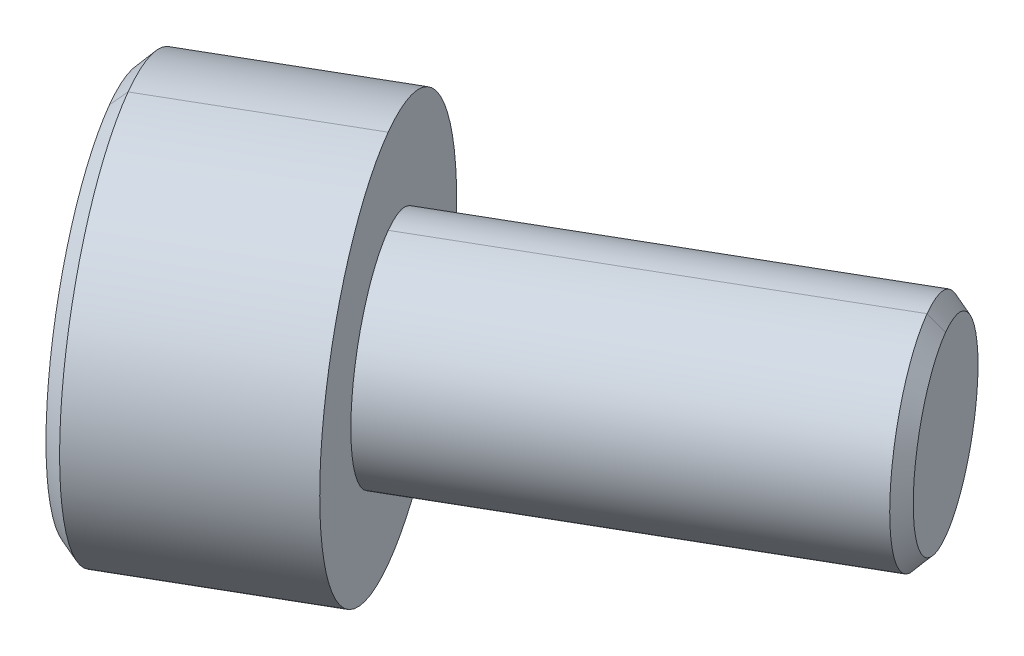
ISO-10303-21;
HEADER;
FILE_DESCRIPTION(('STEP AP214'),'2;1');
FILE_NAME('part.step','',(''),(''),'','','');
FILE_SCHEMA(('AUTOMOTIVE_DESIGN { 1 0 10303 214 1 1 1 1 }'));
ENDSEC;
DATA;
#1=APPLICATION_CONTEXT('core data for automotive mechanical design processes');
#2=APPLICATION_PROTOCOL_DEFINITION('international standard','automotive_design',2000,#1);
#3=PRODUCT_CONTEXT('',#1,'mechanical');
#4=PRODUCT('Part','Part','',(#3));
#5=PRODUCT_RELATED_PRODUCT_CATEGORY('part','',(#4));
#6=PRODUCT_DEFINITION_FORMATION('','',#4);
#7=PRODUCT_DEFINITION_CONTEXT('part definition',#1,'design');
#8=PRODUCT_DEFINITION('design','',#6,#7);
#9=PRODUCT_DEFINITION_SHAPE('','',#8);
#10=(LENGTH_UNIT() NAMED_UNIT(*) SI_UNIT(.MILLI.,.METRE.));
#11=(NAMED_UNIT(*) PLANE_ANGLE_UNIT() SI_UNIT($,.RADIAN.));
#12=(NAMED_UNIT(*) SI_UNIT($,.STERADIAN.) SOLID_ANGLE_UNIT());
#13=UNCERTAINTY_MEASURE_WITH_UNIT(LENGTH_MEASURE(1.E-05),#10,'distance_accuracy_value','');
#14=(GEOMETRIC_REPRESENTATION_CONTEXT(3) GLOBAL_UNCERTAINTY_ASSIGNED_CONTEXT((#13)) GLOBAL_UNIT_ASSIGNED_CONTEXT((#10,
#11,#12)) REPRESENTATION_CONTEXT('',''));
#15=CARTESIAN_POINT('',(0.,0.,0.));
#16=DIRECTION('',(0.,0.,1.));
#17=DIRECTION('',(1.,0.,0.));
#18=AXIS2_PLACEMENT_3D('',#15,#16,#17);
#19=CARTESIAN_POINT('',(-45.29312861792,9.,26.15));
#20=DIRECTION('',(-0.866025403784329,0.,0.50000000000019));
#21=DIRECTION('',(0.,1.,0.));
#22=AXIS2_PLACEMENT_3D('',#19,#20,#21);
#23=PLANE('',#22);
#24=DIRECTION('',(0.250000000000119,0.866025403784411,0.433012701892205));
#25=VECTOR('',#24,1.);
#26=CARTESIAN_POINT('',(-45.65397253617,10.25,25.525));
#27=LINE('',#26,#25);
#28=CARTESIAN_POINT('',(-46.01481645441,9.,24.9));
#29=VERTEX_POINT('',#28);
#30=CARTESIAN_POINT('',(-45.65397253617,10.25,25.525));
#31=VERTEX_POINT('',#30);
#32=EDGE_CURVE('E227',#29,#31,#27,.T.);
#33=ORIENTED_EDGE('',*,*,#32,.F.);
#34=DIRECTION('',(-0.250000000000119,0.866025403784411,-0.433012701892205));
#35=VECTOR('',#34,1.);
#36=CARTESIAN_POINT('',(-46.01481645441,9.,24.9));
#37=LINE('',#36,#35);
#38=CARTESIAN_POINT('',(-45.65397253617,7.75,25.525));
#39=VERTEX_POINT('',#38);
#40=EDGE_CURVE('E10',#39,#29,#37,.T.);
#41=ORIENTED_EDGE('',*,*,#40,.F.);
#42=DIRECTION('',(-0.50000000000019,0.,-0.866025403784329));
#43=VECTOR('',#42,1.);
#44=CARTESIAN_POINT('',(-45.65397253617,7.75,25.525));
#45=LINE('',#44,#43);
#46=CARTESIAN_POINT('',(-44.93228469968,7.75,26.775));
#47=VERTEX_POINT('',#46);
#48=EDGE_CURVE('E46',#47,#39,#45,.T.);
#49=ORIENTED_EDGE('',*,*,#48,.F.);
#50=DIRECTION('',(-0.250000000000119,-0.866025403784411,-0.433012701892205));
#51=VECTOR('',#50,1.);
#52=CARTESIAN_POINT('',(-44.93228469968,7.75,26.775));
#53=LINE('',#52,#51);
#54=CARTESIAN_POINT('',(-44.57144078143,9.,27.4));
#55=VERTEX_POINT('',#54);
#56=EDGE_CURVE('E189',#55,#47,#53,.T.);
#57=ORIENTED_EDGE('',*,*,#56,.F.);
#58=DIRECTION('',(0.250000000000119,-0.866025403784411,0.433012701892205));
#59=VECTOR('',#58,1.);
#60=CARTESIAN_POINT('',(-44.57144078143,9.,27.4));
#61=LINE('',#60,#59);
#62=CARTESIAN_POINT('',(-44.93228469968,10.25,26.775));
#63=VERTEX_POINT('',#62);
#64=EDGE_CURVE('E214',#63,#55,#61,.T.);
#65=ORIENTED_EDGE('',*,*,#64,.F.);
#66=DIRECTION('',(0.50000000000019,0.,0.866025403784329));
#67=VECTOR('',#66,1.);
#68=CARTESIAN_POINT('',(-44.93228469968,10.25,26.775));
#69=LINE('',#68,#67);
#70=EDGE_CURVE('E226',#31,#63,#69,.T.);
#71=ORIENTED_EDGE('',*,*,#70,.F.);
#72=EDGE_LOOP('',(#33,#41,#49,#57,#65,#71));
#73=FACE_BOUND('',#72,.T.);
#74=ADVANCED_FACE('F16',(#73),#23,.T.);
#75=CARTESIAN_POINT('',(-46.01481645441,9.,24.9));
#76=DIRECTION('',(0.433012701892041,0.500000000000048,0.750000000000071));
#77=DIRECTION('',(0.755928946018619,-0.654653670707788,0.));
#78=AXIS2_PLACEMENT_3D('',#75,#76,#77);
#79=PLANE('',#78);
#80=DIRECTION('',(-0.250000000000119,0.866025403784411,-0.433012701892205));
#81=VECTOR('',#80,1.);
#82=CARTESIAN_POINT('',(-47.31385456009,9.,25.65));
#83=LINE('',#82,#81);
#84=CARTESIAN_POINT('',(-46.95301064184,7.75,26.275));
#85=VERTEX_POINT('',#84);
#86=CARTESIAN_POINT('',(-47.31385456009,9.,25.65));
#87=VERTEX_POINT('',#86);
#88=EDGE_CURVE('E202',#85,#87,#83,.T.);
#89=ORIENTED_EDGE('',*,*,#88,.F.);
#90=DIRECTION('',(-0.866025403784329,0.,0.50000000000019));
#91=VECTOR('',#90,1.);
#92=CARTESIAN_POINT('',(-45.65397253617,7.75,25.525));
#93=LINE('',#92,#91);
#94=EDGE_CURVE('E26',#39,#85,#93,.T.);
#95=ORIENTED_EDGE('',*,*,#94,.F.);
#96=ORIENTED_EDGE('',*,*,#40,.T.);
#97=DIRECTION('',(-0.866025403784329,0.,0.50000000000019));
#98=VECTOR('',#97,1.);
#99=CARTESIAN_POINT('',(-46.01481645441,9.,24.9));
#100=LINE('',#99,#98);
#101=EDGE_CURVE('E231',#29,#87,#100,.T.);
#102=ORIENTED_EDGE('',*,*,#101,.T.);
#103=EDGE_LOOP('',(#89,#95,#96,#102));
#104=FACE_BOUND('',#103,.T.);
#105=ADVANCED_FACE('F326',(#104),#79,.T.);
#106=CARTESIAN_POINT('',(-45.65397253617,7.75,25.525));
#107=DIRECTION('',(0.,1.,0.));
#108=DIRECTION('',(0.,0.,-1.));
#109=AXIS2_PLACEMENT_3D('',#106,#107,#108);
#110=PLANE('',#109);
#111=DIRECTION('',(-0.50000000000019,0.,-0.866025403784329));
#112=VECTOR('',#111,1.);
#113=CARTESIAN_POINT('',(-46.95301064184,7.75,26.275));
#114=LINE('',#113,#112);
#115=CARTESIAN_POINT('',(-46.23132280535,7.75,27.525));
#116=VERTEX_POINT('',#115);
#117=EDGE_CURVE('E160',#116,#85,#114,.T.);
#118=ORIENTED_EDGE('',*,*,#117,.F.);
#119=DIRECTION('',(-0.866025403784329,0.,0.50000000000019));
#120=VECTOR('',#119,1.);
#121=CARTESIAN_POINT('',(-44.93228469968,7.75,26.775));
#122=LINE('',#121,#120);
#123=EDGE_CURVE('E192',#47,#116,#122,.T.);
#124=ORIENTED_EDGE('',*,*,#123,.F.);
#125=ORIENTED_EDGE('',*,*,#48,.T.);
#126=ORIENTED_EDGE('',*,*,#94,.T.);
#127=EDGE_LOOP('',(#118,#124,#125,#126));
#128=FACE_BOUND('',#127,.T.);
#129=ADVANCED_FACE('F331',(#128),#110,.T.);
#130=CARTESIAN_POINT('',(-44.93228469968,7.75,26.775));
#131=DIRECTION('',(-0.433012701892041,0.500000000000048,-0.750000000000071));
#132=DIRECTION('',(-0.866025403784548,0.,0.49999999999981));
#133=AXIS2_PLACEMENT_3D('',#130,#131,#132);
#134=PLANE('',#133);
#135=DIRECTION('',(-0.250000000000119,-0.866025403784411,-0.433012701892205));
#136=VECTOR('',#135,1.);
#137=CARTESIAN_POINT('',(-46.23132280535,7.75,27.525));
#138=LINE('',#137,#136);
#139=CARTESIAN_POINT('',(-45.87047888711,9.,28.15));
#140=VERTEX_POINT('',#139);
#141=EDGE_CURVE('E203',#140,#116,#138,.T.);
#142=ORIENTED_EDGE('',*,*,#141,.F.);
#143=DIRECTION('',(-0.866025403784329,0.,0.50000000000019));
#144=VECTOR('',#143,1.);
#145=CARTESIAN_POINT('',(-44.57144078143,9.,27.4));
#146=LINE('',#145,#144);
#147=EDGE_CURVE('E193',#55,#140,#146,.T.);
#148=ORIENTED_EDGE('',*,*,#147,.F.);
#149=ORIENTED_EDGE('',*,*,#56,.T.);
#150=ORIENTED_EDGE('',*,*,#123,.T.);
#151=EDGE_LOOP('',(#142,#148,#149,#150));
#152=FACE_BOUND('',#151,.T.);
#153=ADVANCED_FACE('F341',(#152),#134,.T.);
#154=CARTESIAN_POINT('',(-44.57144078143,9.,27.4));
#155=DIRECTION('',(-0.433012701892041,-0.500000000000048,-0.750000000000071));
#156=DIRECTION('',(0.,-0.832050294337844,0.554700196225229));
#157=AXIS2_PLACEMENT_3D('',#154,#155,#156);
#158=PLANE('',#157);
#159=DIRECTION('',(0.250000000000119,-0.866025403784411,0.433012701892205));
#160=VECTOR('',#159,1.);
#161=CARTESIAN_POINT('',(-45.87047888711,9.,28.15));
#162=LINE('',#161,#160);
#163=CARTESIAN_POINT('',(-46.23132280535,10.25,27.525));
#164=VERTEX_POINT('',#163);
#165=EDGE_CURVE('E207',#164,#140,#162,.T.);
#166=ORIENTED_EDGE('',*,*,#165,.F.);
#167=DIRECTION('',(-0.866025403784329,0.,0.50000000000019));
#168=VECTOR('',#167,1.);
#169=CARTESIAN_POINT('',(-44.93228469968,10.25,26.775));
#170=LINE('',#169,#168);
#171=EDGE_CURVE('E245',#63,#164,#170,.T.);
#172=ORIENTED_EDGE('',*,*,#171,.F.);
#173=ORIENTED_EDGE('',*,*,#64,.T.);
#174=ORIENTED_EDGE('',*,*,#147,.T.);
#175=EDGE_LOOP('',(#166,#172,#173,#174));
#176=FACE_BOUND('',#175,.T.);
#177=ADVANCED_FACE('F343',(#176),#158,.T.);
#178=CARTESIAN_POINT('',(-44.93228469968,10.25,26.775));
#179=DIRECTION('',(0.,-1.,0.));
#180=DIRECTION('',(0.,0.,-1.));
#181=AXIS2_PLACEMENT_3D('',#178,#179,#180);
#182=PLANE('',#181);
#183=DIRECTION('',(0.50000000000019,0.,0.866025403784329));
#184=VECTOR('',#183,1.);
#185=CARTESIAN_POINT('',(-46.23132280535,10.25,27.525));
#186=LINE('',#185,#184);
#187=CARTESIAN_POINT('',(-46.95301064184,10.25,26.275));
#188=VERTEX_POINT('',#187);
#189=EDGE_CURVE('E201',#188,#164,#186,.T.);
#190=ORIENTED_EDGE('',*,*,#189,.F.);
#191=DIRECTION('',(-0.866025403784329,0.,0.50000000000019));
#192=VECTOR('',#191,1.);
#193=CARTESIAN_POINT('',(-45.65397253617,10.25,25.525));
#194=LINE('',#193,#192);
#195=EDGE_CURVE('E223',#31,#188,#194,.T.);
#196=ORIENTED_EDGE('',*,*,#195,.F.);
#197=ORIENTED_EDGE('',*,*,#70,.T.);
#198=ORIENTED_EDGE('',*,*,#171,.T.);
#199=EDGE_LOOP('',(#190,#196,#197,#198));
#200=FACE_BOUND('',#199,.T.);
#201=ADVANCED_FACE('F356',(#200),#182,.T.);
#202=CARTESIAN_POINT('',(-45.65397253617,10.25,25.525));
#203=DIRECTION('',(0.433012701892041,-0.500000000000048,0.750000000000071));
#204=DIRECTION('',(-0.755928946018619,-0.654653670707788,0.));
#205=AXIS2_PLACEMENT_3D('',#202,#203,#204);
#206=PLANE('',#205);
#207=DIRECTION('',(0.250000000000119,0.866025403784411,0.433012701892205));
#208=VECTOR('',#207,1.);
#209=CARTESIAN_POINT('',(-46.95301064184,10.25,26.275));
#210=LINE('',#209,#208);
#211=EDGE_CURVE('E197',#87,#188,#210,.T.);
#212=ORIENTED_EDGE('',*,*,#211,.F.);
#213=ORIENTED_EDGE('',*,*,#101,.F.);
#214=ORIENTED_EDGE('',*,*,#32,.T.);
#215=ORIENTED_EDGE('',*,*,#195,.T.);
#216=EDGE_LOOP('',(#212,#213,#214,#215));
#217=FACE_BOUND('',#216,.T.);
#218=ADVANCED_FACE('F340',(#217),#206,.T.);
#219=CARTESIAN_POINT('',(-39.44793808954,9.,21.27416697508));
#220=DIRECTION('',(0.866025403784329,0.,-0.50000000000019));
#221=DIRECTION('',(0.,-1.,0.));
#222=AXIS2_PLACEMENT_3D('',#219,#220,#221);
#223=PLANE('',#222);
#224=CARTESIAN_POINT('',(-38.79793808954,9.,22.4));
#225=DIRECTION('',(-0.866025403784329,0.,0.50000000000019));
#226=DIRECTION('',(0.,1.,0.));
#227=AXIS2_PLACEMENT_3D('',#224,#225,#226);
#228=CIRCLE('',#227,1.3);
#229=CARTESIAN_POINT('',(-38.79793808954,10.3,22.4));
#230=VERTEX_POINT('',#229);
#231=CARTESIAN_POINT('',(-38.79793808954,7.7,22.4));
#232=VERTEX_POINT('',#231);
#233=EDGE_CURVE('E277',#230,#232,#228,.T.);
#234=ORIENTED_EDGE('',*,*,#233,.F.);
#235=CARTESIAN_POINT('',(-38.79793808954,9.,22.4));
#236=DIRECTION('',(-0.866025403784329,0.,0.50000000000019));
#237=DIRECTION('',(0.,1.,0.));
#238=AXIS2_PLACEMENT_3D('',#235,#236,#237);
#239=CIRCLE('',#238,1.3);
#240=EDGE_CURVE('E59',#232,#230,#239,.T.);
#241=ORIENTED_EDGE('',*,*,#240,.F.);
#242=EDGE_LOOP('',(#234,#241));
#243=FACE_BOUND('',#242,.T.);
#244=ADVANCED_FACE('F337',(#243),#223,.T.);
#245=CARTESIAN_POINT('',(-38.9711431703,9.,22.5));
#246=DIRECTION('',(-0.866025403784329,0.,0.50000000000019));
#247=DIRECTION('',(0.,1.,0.));
#248=AXIS2_PLACEMENT_3D('',#245,#246,#247);
#249=CONICAL_SURFACE('',#248,1.5,0.785398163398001);
#250=DIRECTION('',(-0.612372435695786,-0.707106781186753,0.353553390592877));
#251=VECTOR('',#250,1.);
#252=CARTESIAN_POINT('',(-38.9711431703,7.5,22.5));
#253=LINE('',#252,#251);
#254=CARTESIAN_POINT('',(-38.9711431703,7.5,22.5));
#255=VERTEX_POINT('',#254);
#256=EDGE_CURVE('E240',#232,#255,#253,.T.);
#257=ORIENTED_EDGE('',*,*,#256,.F.);
#258=ORIENTED_EDGE('',*,*,#240,.T.);
#259=DIRECTION('',(-0.612372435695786,0.707106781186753,0.353553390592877));
#260=VECTOR('',#259,1.);
#261=CARTESIAN_POINT('',(-38.9711431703,10.5,22.5));
#262=LINE('',#261,#260);
#263=CARTESIAN_POINT('',(-38.9711431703,10.5,22.5));
#264=VERTEX_POINT('',#263);
#265=EDGE_CURVE('E239',#230,#264,#262,.T.);
#266=ORIENTED_EDGE('',*,*,#265,.T.);
#267=CARTESIAN_POINT('',(-38.9711431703,9.,22.5));
#268=DIRECTION('',(-0.866025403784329,0.,0.50000000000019));
#269=DIRECTION('',(0.,1.,0.));
#270=AXIS2_PLACEMENT_3D('',#267,#268,#269);
#271=CIRCLE('',#270,1.5);
#272=EDGE_CURVE('E264',#255,#264,#271,.T.);
#273=ORIENTED_EDGE('',*,*,#272,.F.);
#274=EDGE_LOOP('',(#257,#258,#266,#273));
#275=FACE_BOUND('',#274,.T.);
#276=ADVANCED_FACE('F18',(#275),#249,.T.);
#277=CARTESIAN_POINT('',(-477.0067924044,9.,275.4));
#278=DIRECTION('',(-0.866025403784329,0.,0.50000000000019));
#279=DIRECTION('',(0.,1.,0.));
#280=AXIS2_PLACEMENT_3D('',#277,#278,#279);
#281=CYLINDRICAL_SURFACE('',#280,1.5);
#282=DIRECTION('',(-0.866025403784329,0.,0.50000000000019));
#283=VECTOR('',#282,1.);
#284=CARTESIAN_POINT('',(-477.0067924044,7.5,275.4));
#285=LINE('',#284,#283);
#286=CARTESIAN_POINT('',(-43.99409051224,7.5,25.4));
#287=VERTEX_POINT('',#286);
#288=EDGE_CURVE('E222',#255,#287,#285,.T.);
#289=ORIENTED_EDGE('',*,*,#288,.F.);
#290=ORIENTED_EDGE('',*,*,#272,.T.);
#291=DIRECTION('',(-0.866025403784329,0.,0.50000000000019));
#292=VECTOR('',#291,1.);
#293=CARTESIAN_POINT('',(-477.0067924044,10.5,275.4));
#294=LINE('',#293,#292);
#295=CARTESIAN_POINT('',(-43.99409051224,10.5,25.4));
#296=VERTEX_POINT('',#295);
#297=EDGE_CURVE('E184',#264,#296,#294,.T.);
#298=ORIENTED_EDGE('',*,*,#297,.T.);
#299=CARTESIAN_POINT('',(-43.99409051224,9.,25.4));
#300=DIRECTION('',(-0.866025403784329,0.,0.50000000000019));
#301=DIRECTION('',(0.,1.,0.));
#302=AXIS2_PLACEMENT_3D('',#299,#300,#301);
#303=CIRCLE('',#302,1.5);
#304=EDGE_CURVE('E234',#287,#296,#303,.T.);
#305=ORIENTED_EDGE('',*,*,#304,.F.);
#306=EDGE_LOOP('',(#289,#290,#298,#305));
#307=FACE_BOUND('',#306,.T.);
#308=ADVANCED_FACE('F289',(#307),#281,.T.);
#309=CARTESIAN_POINT('',(-45.36909051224,9.,23.018430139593));
#310=DIRECTION('',(0.866025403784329,0.,-0.50000000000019));
#311=DIRECTION('',(0.,-1.,0.));
#312=AXIS2_PLACEMENT_3D('',#309,#310,#311);
#313=PLANE('',#312);
#314=CARTESIAN_POINT('',(-43.99409051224,9.,25.4));
#315=DIRECTION('',(-0.866025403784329,0.,0.50000000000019));
#316=DIRECTION('',(0.,1.,0.));
#317=AXIS2_PLACEMENT_3D('',#314,#315,#316);
#318=CIRCLE('',#317,2.75);
#319=CARTESIAN_POINT('',(-43.99409051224,11.75,25.4));
#320=VERTEX_POINT('',#319);
#321=CARTESIAN_POINT('',(-43.99409051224,6.25,25.4));
#322=VERTEX_POINT('',#321);
#323=EDGE_CURVE('E177',#320,#322,#318,.T.);
#324=ORIENTED_EDGE('',*,*,#323,.F.);
#325=CARTESIAN_POINT('',(-43.99409051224,9.,25.4));
#326=DIRECTION('',(-0.866025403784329,0.,0.50000000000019));
#327=DIRECTION('',(0.,1.,0.));
#328=AXIS2_PLACEMENT_3D('',#325,#326,#327);
#329=CIRCLE('',#328,2.75);
#330=EDGE_CURVE('E139',#322,#320,#329,.T.);
#331=ORIENTED_EDGE('',*,*,#330,.F.);
#332=EDGE_LOOP('',(#324,#331));
#333=FACE_BOUND('',#332,.T.);
#334=CARTESIAN_POINT('',(-43.99409051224,9.,25.4));
#335=DIRECTION('',(-0.866025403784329,0.,0.50000000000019));
#336=DIRECTION('',(0.,1.,0.));
#337=AXIS2_PLACEMENT_3D('',#334,#335,#336);
#338=CIRCLE('',#337,1.5);
#339=EDGE_CURVE('E218',#296,#287,#338,.T.);
#340=ORIENTED_EDGE('',*,*,#339,.T.);
#341=ORIENTED_EDGE('',*,*,#304,.T.);
#342=EDGE_LOOP('',(#340,#341));
#343=FACE_BOUND('',#342,.T.);
#344=ADVANCED_FACE('F284',(#333,#343),#313,.T.);
#345=CARTESIAN_POINT('',(-477.0067924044,9.,275.4));
#346=DIRECTION('',(-0.866025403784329,0.,0.50000000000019));
#347=DIRECTION('',(0.,1.,0.));
#348=AXIS2_PLACEMENT_3D('',#345,#346,#347);
#349=CYLINDRICAL_SURFACE('',#348,2.75);
#350=DIRECTION('',(-0.866025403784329,0.,0.50000000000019));
#351=VECTOR('',#350,1.);
#352=CARTESIAN_POINT('',(-477.0067924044,6.25,275.4));
#353=LINE('',#352,#351);
#354=CARTESIAN_POINT('',(-46.41896164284,6.25,26.8));
#355=VERTEX_POINT('',#354);
#356=EDGE_CURVE('E151',#322,#355,#353,.T.);
#357=ORIENTED_EDGE('',*,*,#356,.F.);
#358=ORIENTED_EDGE('',*,*,#330,.T.);
#359=DIRECTION('',(-0.866025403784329,0.,0.50000000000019));
#360=VECTOR('',#359,1.);
#361=CARTESIAN_POINT('',(-477.0067924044,11.75,275.4));
#362=LINE('',#361,#360);
#363=CARTESIAN_POINT('',(-46.41896164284,11.75,26.8));
#364=VERTEX_POINT('',#363);
#365=EDGE_CURVE('E154',#320,#364,#362,.T.);
#366=ORIENTED_EDGE('',*,*,#365,.T.);
#367=CARTESIAN_POINT('',(-46.41896164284,9.,26.8));
#368=DIRECTION('',(-0.866025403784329,0.,0.50000000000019));
#369=DIRECTION('',(0.,1.,0.));
#370=AXIS2_PLACEMENT_3D('',#367,#368,#369);
#371=CIRCLE('',#370,2.75);
#372=EDGE_CURVE('E147',#355,#364,#371,.T.);
#373=ORIENTED_EDGE('',*,*,#372,.F.);
#374=EDGE_LOOP('',(#357,#358,#366,#373));
#375=FACE_BOUND('',#374,.T.);
#376=ADVANCED_FACE('F149',(#375),#349,.T.);
#377=CARTESIAN_POINT('',(-46.5921667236,9.,26.9));
#378=DIRECTION('',(0.866025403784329,0.,-0.50000000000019));
#379=DIRECTION('',(0.,-1.,0.));
#380=AXIS2_PLACEMENT_3D('',#377,#378,#379);
#381=CONICAL_SURFACE('',#380,2.55,0.785398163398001);
#382=DIRECTION('',(0.612372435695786,0.707106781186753,-0.353553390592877));
#383=VECTOR('',#382,1.);
#384=CARTESIAN_POINT('',(-46.5921667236,11.55,26.9));
#385=LINE('',#384,#383);
#386=CARTESIAN_POINT('',(-46.5921667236,11.55,26.9));
#387=VERTEX_POINT('',#386);
#388=EDGE_CURVE('E170',#387,#364,#385,.T.);
#389=ORIENTED_EDGE('',*,*,#388,.F.);
#390=CARTESIAN_POINT('',(-46.5921667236,9.,26.9));
#391=DIRECTION('',(-0.866025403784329,0.,0.50000000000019));
#392=DIRECTION('',(0.,1.,0.));
#393=AXIS2_PLACEMENT_3D('',#390,#391,#392);
#394=CIRCLE('',#393,2.55);
#395=CARTESIAN_POINT('',(-46.5921667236,6.45,26.9));
#396=VERTEX_POINT('',#395);
#397=EDGE_CURVE('E165',#396,#387,#394,.T.);
#398=ORIENTED_EDGE('',*,*,#397,.F.);
#399=DIRECTION('',(0.612372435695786,-0.707106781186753,-0.353553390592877));
#400=VECTOR('',#399,1.);
#401=CARTESIAN_POINT('',(-46.5921667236,6.45,26.9));
#402=LINE('',#401,#400);
#403=EDGE_CURVE('E20',#396,#355,#402,.T.);
#404=ORIENTED_EDGE('',*,*,#403,.T.);
#405=ORIENTED_EDGE('',*,*,#372,.T.);
#406=EDGE_LOOP('',(#389,#398,#404,#405));
#407=FACE_BOUND('',#406,.T.);
#408=ADVANCED_FACE('F164',(#407),#381,.T.);
#409=CARTESIAN_POINT('',(-46.5921667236,9.,26.9));
#410=DIRECTION('',(-0.866025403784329,0.,0.50000000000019));
#411=DIRECTION('',(0.,1.,0.));
#412=AXIS2_PLACEMENT_3D('',#409,#410,#411);
#413=PLANE('',#412);
#414=ORIENTED_EDGE('',*,*,#88,.T.);
#415=ORIENTED_EDGE('',*,*,#211,.T.);
#416=ORIENTED_EDGE('',*,*,#189,.T.);
#417=ORIENTED_EDGE('',*,*,#165,.T.);
#418=ORIENTED_EDGE('',*,*,#141,.T.);
#419=ORIENTED_EDGE('',*,*,#117,.T.);
#420=EDGE_LOOP('',(#414,#415,#416,#417,#418,#419));
#421=FACE_BOUND('',#420,.T.);
#422=ORIENTED_EDGE('',*,*,#397,.T.);
#423=CARTESIAN_POINT('',(-46.5921667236,9.,26.9));
#424=DIRECTION('',(-0.866025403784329,0.,0.50000000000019));
#425=DIRECTION('',(0.,1.,0.));
#426=AXIS2_PLACEMENT_3D('',#423,#424,#425);
#427=CIRCLE('',#426,2.55);
#428=EDGE_CURVE('E196',#387,#396,#427,.T.);
#429=ORIENTED_EDGE('',*,*,#428,.T.);
#430=EDGE_LOOP('',(#422,#429));
#431=FACE_BOUND('',#430,.T.);
#432=ADVANCED_FACE('F312',(#421,#431),#413,.T.);
#433=CARTESIAN_POINT('',(-46.5921667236,9.,26.9));
#434=DIRECTION('',(0.866025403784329,0.,-0.50000000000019));
#435=DIRECTION('',(0.,-1.,0.));
#436=AXIS2_PLACEMENT_3D('',#433,#434,#435);
#437=CONICAL_SURFACE('',#436,2.55,0.785398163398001);
#438=ORIENTED_EDGE('',*,*,#428,.F.);
#439=ORIENTED_EDGE('',*,*,#388,.T.);
#440=CARTESIAN_POINT('',(-46.41896164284,9.,26.8));
#441=DIRECTION('',(-0.866025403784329,0.,0.50000000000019));
#442=DIRECTION('',(0.,1.,0.));
#443=AXIS2_PLACEMENT_3D('',#440,#441,#442);
#444=CIRCLE('',#443,2.75);
#445=EDGE_CURVE('E171',#364,#355,#444,.T.);
#446=ORIENTED_EDGE('',*,*,#445,.T.);
#447=ORIENTED_EDGE('',*,*,#403,.F.);
#448=EDGE_LOOP('',(#438,#439,#446,#447));
#449=FACE_BOUND('',#448,.T.);
#450=ADVANCED_FACE('F172',(#449),#437,.T.);
#451=CARTESIAN_POINT('',(-477.0067924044,9.,275.4));
#452=DIRECTION('',(-0.866025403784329,0.,0.50000000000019));
#453=DIRECTION('',(0.,1.,0.));
#454=AXIS2_PLACEMENT_3D('',#451,#452,#453);
#455=CYLINDRICAL_SURFACE('',#454,2.75);
#456=ORIENTED_EDGE('',*,*,#323,.T.);
#457=ORIENTED_EDGE('',*,*,#356,.T.);
#458=ORIENTED_EDGE('',*,*,#445,.F.);
#459=ORIENTED_EDGE('',*,*,#365,.F.);
#460=EDGE_LOOP('',(#456,#457,#458,#459));
#461=FACE_BOUND('',#460,.T.);
#462=ADVANCED_FACE('F176',(#461),#455,.T.);
#463=CARTESIAN_POINT('',(-477.0067924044,9.,275.4));
#464=DIRECTION('',(-0.866025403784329,0.,0.50000000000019));
#465=DIRECTION('',(0.,1.,0.));
#466=AXIS2_PLACEMENT_3D('',#463,#464,#465);
#467=CYLINDRICAL_SURFACE('',#466,1.5);
#468=CARTESIAN_POINT('',(-38.9711431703,9.,22.5));
#469=DIRECTION('',(-0.866025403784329,0.,0.50000000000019));
#470=DIRECTION('',(0.,1.,0.));
#471=AXIS2_PLACEMENT_3D('',#468,#469,#470);
#472=CIRCLE('',#471,1.5);
#473=EDGE_CURVE('E235',#264,#255,#472,.T.);
#474=ORIENTED_EDGE('',*,*,#473,.T.);
#475=ORIENTED_EDGE('',*,*,#288,.T.);
#476=ORIENTED_EDGE('',*,*,#339,.F.);
#477=ORIENTED_EDGE('',*,*,#297,.F.);
#478=EDGE_LOOP('',(#474,#475,#476,#477));
#479=FACE_BOUND('',#478,.T.);
#480=ADVANCED_FACE('F291',(#479),#467,.T.);
#481=CARTESIAN_POINT('',(-38.9711431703,9.,22.5));
#482=DIRECTION('',(-0.866025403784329,0.,0.50000000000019));
#483=DIRECTION('',(0.,1.,0.));
#484=AXIS2_PLACEMENT_3D('',#481,#482,#483);
#485=CONICAL_SURFACE('',#484,1.5,0.785398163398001);
#486=ORIENTED_EDGE('',*,*,#233,.T.);
#487=ORIENTED_EDGE('',*,*,#256,.T.);
#488=ORIENTED_EDGE('',*,*,#473,.F.);
#489=ORIENTED_EDGE('',*,*,#265,.F.);
#490=EDGE_LOOP('',(#486,#487,#488,#489));
#491=FACE_BOUND('',#490,.T.);
#492=ADVANCED_FACE('F295',(#491),#485,.T.);
#493=CLOSED_SHELL('',(#74,#105,#129,#153,#177,#201,#218,#244,#276,#308,#344,#376,#408,#432,#450,
#462,#480,#492));
#494=MANIFOLD_SOLID_BREP('B1',#493);
#495=ADVANCED_BREP_SHAPE_REPRESENTATION('',(#18,#494),#14);
#496=SHAPE_DEFINITION_REPRESENTATION(#9,#495);
ENDSEC;
END-ISO-10303-21;
